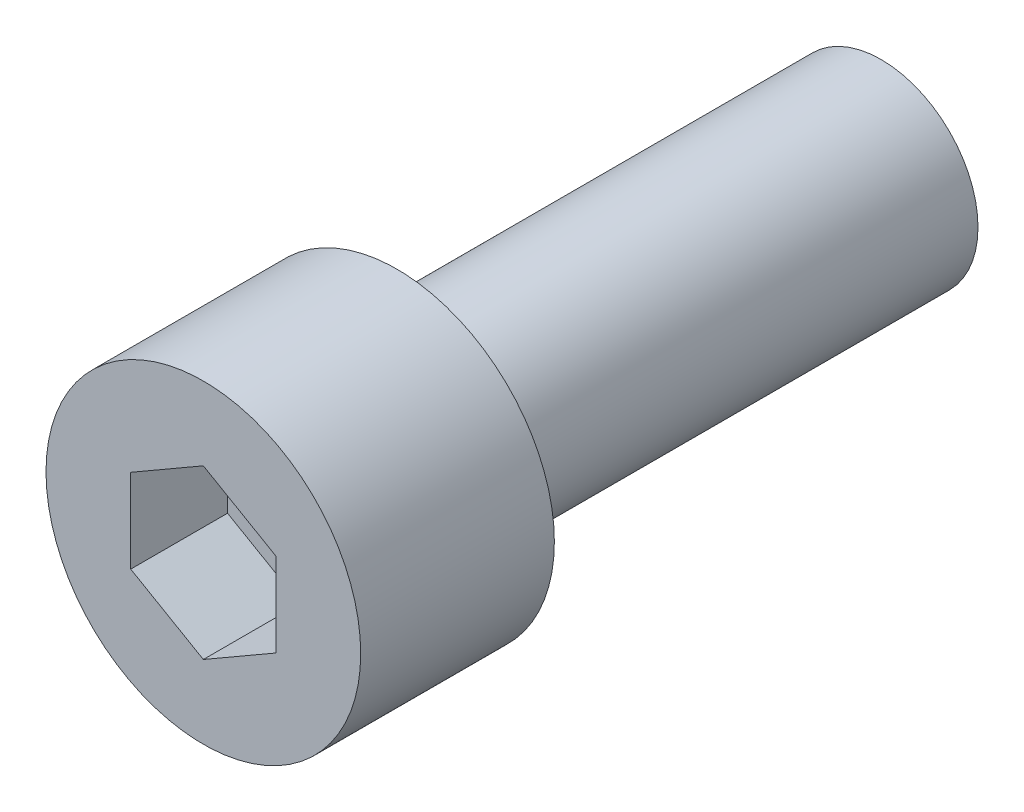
ISO-10303-21;
HEADER;
FILE_DESCRIPTION(('STEP AP214'),'2;1');
FILE_NAME('part.step','',(''),(''),'','','');
FILE_SCHEMA(('AUTOMOTIVE_DESIGN { 1 0 10303 214 1 1 1 1 }'));
ENDSEC;
DATA;
#1=APPLICATION_CONTEXT('core data for automotive mechanical design processes');
#2=APPLICATION_PROTOCOL_DEFINITION('international standard','automotive_design',2000,#1);
#3=PRODUCT_CONTEXT('',#1,'mechanical');
#4=PRODUCT('Part','Part','',(#3));
#5=PRODUCT_RELATED_PRODUCT_CATEGORY('part','',(#4));
#6=PRODUCT_DEFINITION_FORMATION('','',#4);
#7=PRODUCT_DEFINITION_CONTEXT('part definition',#1,'design');
#8=PRODUCT_DEFINITION('design','',#6,#7);
#9=PRODUCT_DEFINITION_SHAPE('','',#8);
#10=(LENGTH_UNIT() NAMED_UNIT(*) SI_UNIT(.MILLI.,.METRE.));
#11=(NAMED_UNIT(*) PLANE_ANGLE_UNIT() SI_UNIT($,.RADIAN.));
#12=(NAMED_UNIT(*) SI_UNIT($,.STERADIAN.) SOLID_ANGLE_UNIT());
#13=UNCERTAINTY_MEASURE_WITH_UNIT(LENGTH_MEASURE(1.E-05),#10,'distance_accuracy_value','');
#14=(GEOMETRIC_REPRESENTATION_CONTEXT(3) GLOBAL_UNCERTAINTY_ASSIGNED_CONTEXT((#13)) GLOBAL_UNIT_ASSIGNED_CONTEXT((#10,
#11,#12)) REPRESENTATION_CONTEXT('',''));
#15=CARTESIAN_POINT('',(0.,0.,0.));
#16=DIRECTION('',(0.,0.,1.));
#17=DIRECTION('',(1.,0.,0.));
#18=AXIS2_PLACEMENT_3D('',#15,#16,#17);
#19=CARTESIAN_POINT('',(4.,0.,-20.));
#20=DIRECTION('',(0.,0.,-1.));
#21=DIRECTION('',(-1.,0.,0.));
#22=AXIS2_PLACEMENT_3D('',#19,#20,#21);
#23=PLANE('',#22);
#24=CARTESIAN_POINT('',(0.,0.,-20.));
#25=DIRECTION('',(0.,0.,-1.));
#26=DIRECTION('',(-1.,0.,0.));
#27=AXIS2_PLACEMENT_3D('',#24,#25,#26);
#28=CIRCLE('',#27,4.);
#29=CARTESIAN_POINT('',(-4.,0.,-20.));
#30=VERTEX_POINT('',#29);
#31=EDGE_CURVE('E11',#30,#30,#28,.T.);
#32=ORIENTED_EDGE('',*,*,#31,.T.);
#33=EDGE_LOOP('',(#32));
#34=FACE_BOUND('',#33,.T.);
#35=ADVANCED_FACE('F17',(#34),#23,.T.);
#36=CARTESIAN_POINT('',(0.,3.46410161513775,4.));
#37=DIRECTION('',(-0.5,-0.86602540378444,0.));
#38=DIRECTION('',(0.86602540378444,-0.5,0.));
#39=AXIS2_PLACEMENT_3D('',#36,#37,#38);
#40=PLANE('',#39);
#41=DIRECTION('',(0.,0.,1.));
#42=VECTOR('',#41,1.);
#43=CARTESIAN_POINT('',(3.,1.73205080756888,4.));
#44=LINE('',#43,#42);
#45=CARTESIAN_POINT('',(3.,1.73205080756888,4.));
#46=VERTEX_POINT('',#45);
#47=CARTESIAN_POINT('',(3.,1.73205080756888,8.));
#48=VERTEX_POINT('',#47);
#49=EDGE_CURVE('E66',#46,#48,#44,.T.);
#50=ORIENTED_EDGE('',*,*,#49,.T.);
#51=DIRECTION('',(0.86602540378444,-0.5,0.));
#52=VECTOR('',#51,1.);
#53=CARTESIAN_POINT('',(0.,3.46410161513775,8.));
#54=LINE('',#53,#52);
#55=CARTESIAN_POINT('',(0.,3.46410161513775,8.));
#56=VERTEX_POINT('',#55);
#57=EDGE_CURVE('E32',#56,#48,#54,.T.);
#58=ORIENTED_EDGE('',*,*,#57,.F.);
#59=DIRECTION('',(0.,0.,1.));
#60=VECTOR('',#59,1.);
#61=CARTESIAN_POINT('',(0.,3.46410161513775,4.));
#62=LINE('',#61,#60);
#63=CARTESIAN_POINT('',(0.,3.46410161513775,4.));
#64=VERTEX_POINT('',#63);
#65=EDGE_CURVE('E36',#64,#56,#62,.T.);
#66=ORIENTED_EDGE('',*,*,#65,.F.);
#67=DIRECTION('',(0.86602540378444,-0.5,0.));
#68=VECTOR('',#67,1.);
#69=CARTESIAN_POINT('',(0.,3.46410161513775,4.));
#70=LINE('',#69,#68);
#71=EDGE_CURVE('E69',#64,#46,#70,.T.);
#72=ORIENTED_EDGE('',*,*,#71,.T.);
#73=EDGE_LOOP('',(#50,#58,#66,#72));
#74=FACE_BOUND('',#73,.T.);
#75=ADVANCED_FACE('F68',(#74),#40,.T.);
#76=CARTESIAN_POINT('',(3.,-1.73205080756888,4.));
#77=DIRECTION('',(1.,0.,0.));
#78=DIRECTION('',(0.,0.,-1.));
#79=AXIS2_PLACEMENT_3D('',#76,#77,#78);
#80=PLANE('',#79);
#81=DIRECTION('',(0.,0.,1.));
#82=VECTOR('',#81,1.);
#83=CARTESIAN_POINT('',(3.,-1.73205080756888,4.));
#84=LINE('',#83,#82);
#85=CARTESIAN_POINT('',(3.,-1.73205080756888,4.));
#86=VERTEX_POINT('',#85);
#87=CARTESIAN_POINT('',(3.,-1.73205080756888,8.));
#88=VERTEX_POINT('',#87);
#89=EDGE_CURVE('E74',#86,#88,#84,.T.);
#90=ORIENTED_EDGE('',*,*,#89,.T.);
#91=DIRECTION('',(0.,1.,0.));
#92=VECTOR('',#91,1.);
#93=CARTESIAN_POINT('',(3.,-1.73205080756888,8.));
#94=LINE('',#93,#92);
#95=EDGE_CURVE('E77',#88,#48,#94,.T.);
#96=ORIENTED_EDGE('',*,*,#95,.T.);
#97=ORIENTED_EDGE('',*,*,#49,.F.);
#98=DIRECTION('',(0.,1.,0.));
#99=VECTOR('',#98,1.);
#100=CARTESIAN_POINT('',(3.,-1.73205080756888,4.));
#101=LINE('',#100,#99);
#102=EDGE_CURVE('E104',#86,#46,#101,.T.);
#103=ORIENTED_EDGE('',*,*,#102,.F.);
#104=EDGE_LOOP('',(#90,#96,#97,#103));
#105=FACE_BOUND('',#104,.T.);
#106=ADVANCED_FACE('F78',(#105),#80,.F.);
#107=CARTESIAN_POINT('',(0.,-3.46410161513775,4.));
#108=DIRECTION('',(0.5,-0.86602540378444,0.));
#109=DIRECTION('',(0.86602540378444,0.5,0.));
#110=AXIS2_PLACEMENT_3D('',#107,#108,#109);
#111=PLANE('',#110);
#112=DIRECTION('',(0.,0.,1.));
#113=VECTOR('',#112,1.);
#114=CARTESIAN_POINT('',(0.,-3.46410161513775,4.));
#115=LINE('',#114,#113);
#116=CARTESIAN_POINT('',(0.,-3.46410161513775,4.));
#117=VERTEX_POINT('',#116);
#118=CARTESIAN_POINT('',(0.,-3.46410161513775,8.));
#119=VERTEX_POINT('',#118);
#120=EDGE_CURVE('E112',#117,#119,#115,.T.);
#121=ORIENTED_EDGE('',*,*,#120,.T.);
#122=DIRECTION('',(0.86602540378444,0.5,0.));
#123=VECTOR('',#122,1.);
#124=CARTESIAN_POINT('',(0.,-3.46410161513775,8.));
#125=LINE('',#124,#123);
#126=EDGE_CURVE('E82',#119,#88,#125,.T.);
#127=ORIENTED_EDGE('',*,*,#126,.T.);
#128=ORIENTED_EDGE('',*,*,#89,.F.);
#129=DIRECTION('',(0.86602540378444,0.5,0.));
#130=VECTOR('',#129,1.);
#131=CARTESIAN_POINT('',(0.,-3.46410161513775,4.));
#132=LINE('',#131,#130);
#133=EDGE_CURVE('E101',#117,#86,#132,.T.);
#134=ORIENTED_EDGE('',*,*,#133,.F.);
#135=EDGE_LOOP('',(#121,#127,#128,#134));
#136=FACE_BOUND('',#135,.T.);
#137=ADVANCED_FACE('F213',(#136),#111,.F.);
#138=CARTESIAN_POINT('',(0.,-3.46410161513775,4.));
#139=DIRECTION('',(0.5,0.86602540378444,0.));
#140=DIRECTION('',(-0.86602540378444,0.5,0.));
#141=AXIS2_PLACEMENT_3D('',#138,#139,#140);
#142=PLANE('',#141);
#143=DIRECTION('',(0.,0.,1.));
#144=VECTOR('',#143,1.);
#145=CARTESIAN_POINT('',(-3.,-1.73205080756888,4.));
#146=LINE('',#145,#144);
#147=CARTESIAN_POINT('',(-3.,-1.73205080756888,4.));
#148=VERTEX_POINT('',#147);
#149=CARTESIAN_POINT('',(-3.,-1.73205080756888,8.));
#150=VERTEX_POINT('',#149);
#151=EDGE_CURVE('E110',#148,#150,#146,.T.);
#152=ORIENTED_EDGE('',*,*,#151,.T.);
#153=DIRECTION('',(-0.86602540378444,0.5,0.));
#154=VECTOR('',#153,1.);
#155=CARTESIAN_POINT('',(0.,-3.46410161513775,8.));
#156=LINE('',#155,#154);
#157=EDGE_CURVE('E250',#119,#150,#156,.T.);
#158=ORIENTED_EDGE('',*,*,#157,.F.);
#159=ORIENTED_EDGE('',*,*,#120,.F.);
#160=DIRECTION('',(-0.86602540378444,0.5,0.));
#161=VECTOR('',#160,1.);
#162=CARTESIAN_POINT('',(0.,-3.46410161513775,4.));
#163=LINE('',#162,#161);
#164=EDGE_CURVE('E98',#117,#148,#163,.T.);
#165=ORIENTED_EDGE('',*,*,#164,.T.);
#166=EDGE_LOOP('',(#152,#158,#159,#165));
#167=FACE_BOUND('',#166,.T.);
#168=ADVANCED_FACE('F203',(#167),#142,.T.);
#169=CARTESIAN_POINT('',(-3.,1.73205080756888,4.));
#170=DIRECTION('',(-1.,0.,0.));
#171=DIRECTION('',(0.,-1.,0.));
#172=AXIS2_PLACEMENT_3D('',#169,#170,#171);
#173=PLANE('',#172);
#174=DIRECTION('',(0.,0.,1.));
#175=VECTOR('',#174,1.);
#176=CARTESIAN_POINT('',(-3.,1.73205080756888,4.));
#177=LINE('',#176,#175);
#178=CARTESIAN_POINT('',(-3.,1.73205080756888,4.));
#179=VERTEX_POINT('',#178);
#180=CARTESIAN_POINT('',(-3.,1.73205080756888,8.));
#181=VERTEX_POINT('',#180);
#182=EDGE_CURVE('E108',#179,#181,#177,.T.);
#183=ORIENTED_EDGE('',*,*,#182,.T.);
#184=DIRECTION('',(0.,-1.,0.));
#185=VECTOR('',#184,1.);
#186=CARTESIAN_POINT('',(-3.,1.73205080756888,8.));
#187=LINE('',#186,#185);
#188=EDGE_CURVE('E252',#181,#150,#187,.T.);
#189=ORIENTED_EDGE('',*,*,#188,.T.);
#190=ORIENTED_EDGE('',*,*,#151,.F.);
#191=DIRECTION('',(0.,-1.,0.));
#192=VECTOR('',#191,1.);
#193=CARTESIAN_POINT('',(-3.,1.73205080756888,4.));
#194=LINE('',#193,#192);
#195=EDGE_CURVE('E95',#179,#148,#194,.T.);
#196=ORIENTED_EDGE('',*,*,#195,.F.);
#197=EDGE_LOOP('',(#183,#189,#190,#196));
#198=FACE_BOUND('',#197,.T.);
#199=ADVANCED_FACE('F186',(#198),#173,.F.);
#200=CARTESIAN_POINT('',(0.,3.46410161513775,4.));
#201=DIRECTION('',(-0.5,0.86602540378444,0.));
#202=DIRECTION('',(-0.86602540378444,-0.5,0.));
#203=AXIS2_PLACEMENT_3D('',#200,#201,#202);
#204=PLANE('',#203);
#205=DIRECTION('',(-0.86602540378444,-0.5,0.));
#206=VECTOR('',#205,1.);
#207=CARTESIAN_POINT('',(0.,3.46410161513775,4.));
#208=LINE('',#207,#206);
#209=EDGE_CURVE('E92',#64,#179,#208,.T.);
#210=ORIENTED_EDGE('',*,*,#209,.F.);
#211=ORIENTED_EDGE('',*,*,#65,.T.);
#212=DIRECTION('',(-0.86602540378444,-0.5,0.));
#213=VECTOR('',#212,1.);
#214=CARTESIAN_POINT('',(0.,3.46410161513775,8.));
#215=LINE('',#214,#213);
#216=EDGE_CURVE('E88',#56,#181,#215,.T.);
#217=ORIENTED_EDGE('',*,*,#216,.T.);
#218=ORIENTED_EDGE('',*,*,#182,.F.);
#219=EDGE_LOOP('',(#210,#211,#217,#218));
#220=FACE_BOUND('',#219,.T.);
#221=ADVANCED_FACE('F138',(#220),#204,.F.);
#222=CARTESIAN_POINT('',(-3.,5.19615242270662,4.));
#223=DIRECTION('',(0.,0.,-1.));
#224=DIRECTION('',(-1.,0.,0.));
#225=AXIS2_PLACEMENT_3D('',#222,#223,#224);
#226=PLANE('',#225);
#227=ORIENTED_EDGE('',*,*,#71,.F.);
#228=ORIENTED_EDGE('',*,*,#209,.T.);
#229=ORIENTED_EDGE('',*,*,#195,.T.);
#230=ORIENTED_EDGE('',*,*,#164,.F.);
#231=ORIENTED_EDGE('',*,*,#133,.T.);
#232=ORIENTED_EDGE('',*,*,#102,.T.);
#233=EDGE_LOOP('',(#227,#228,#229,#230,#231,#232));
#234=FACE_BOUND('',#233,.T.);
#235=ADVANCED_FACE('F136',(#234),#226,.F.);
#236=CARTESIAN_POINT('',(0.,0.,8.));
#237=DIRECTION('',(0.,0.,1.));
#238=DIRECTION('',(1.,0.,0.));
#239=AXIS2_PLACEMENT_3D('',#236,#237,#238);
#240=PLANE('',#239);
#241=CARTESIAN_POINT('',(0.,0.,8.));
#242=DIRECTION('',(0.,0.,1.));
#243=DIRECTION('',(1.,0.,0.));
#244=AXIS2_PLACEMENT_3D('',#241,#242,#243);
#245=CIRCLE('',#244,6.5);
#246=CARTESIAN_POINT('',(6.5,0.,8.));
#247=VERTEX_POINT('',#246);
#248=EDGE_CURVE('E25',#247,#247,#245,.T.);
#249=ORIENTED_EDGE('',*,*,#248,.T.);
#250=EDGE_LOOP('',(#249));
#251=FACE_BOUND('',#250,.T.);
#252=ORIENTED_EDGE('',*,*,#216,.F.);
#253=ORIENTED_EDGE('',*,*,#57,.T.);
#254=ORIENTED_EDGE('',*,*,#95,.F.);
#255=ORIENTED_EDGE('',*,*,#126,.F.);
#256=ORIENTED_EDGE('',*,*,#157,.T.);
#257=ORIENTED_EDGE('',*,*,#188,.F.);
#258=EDGE_LOOP('',(#252,#253,#254,#255,#256,#257));
#259=FACE_BOUND('',#258,.T.);
#260=ADVANCED_FACE('F85',(#251,#259),#240,.T.);
#261=CARTESIAN_POINT('',(0.,0.,0.));
#262=DIRECTION('',(0.,0.,1.));
#263=DIRECTION('',(1.,0.,0.));
#264=AXIS2_PLACEMENT_3D('',#261,#262,#263);
#265=CYLINDRICAL_SURFACE('',#264,6.5);
#266=CARTESIAN_POINT('',(0.,0.,0.));
#267=DIRECTION('',(0.,0.,1.));
#268=DIRECTION('',(1.,0.,0.));
#269=AXIS2_PLACEMENT_3D('',#266,#267,#268);
#270=CIRCLE('',#269,6.5);
#271=CARTESIAN_POINT('',(6.5,0.,0.));
#272=VERTEX_POINT('',#271);
#273=EDGE_CURVE('E117',#272,#272,#270,.T.);
#274=ORIENTED_EDGE('',*,*,#273,.T.);
#275=EDGE_LOOP('',(#274));
#276=FACE_BOUND('',#275,.T.);
#277=ORIENTED_EDGE('',*,*,#248,.F.);
#278=EDGE_LOOP('',(#277));
#279=FACE_BOUND('',#278,.T.);
#280=ADVANCED_FACE('F123',(#276,#279),#265,.T.);
#281=CARTESIAN_POINT('',(6.5,0.,0.));
#282=DIRECTION('',(0.,0.,-1.));
#283=DIRECTION('',(-1.,0.,0.));
#284=AXIS2_PLACEMENT_3D('',#281,#282,#283);
#285=PLANE('',#284);
#286=CARTESIAN_POINT('',(0.,0.,0.));
#287=DIRECTION('',(0.,0.,1.));
#288=DIRECTION('',(1.,0.,0.));
#289=AXIS2_PLACEMENT_3D('',#286,#287,#288);
#290=CIRCLE('',#289,4.);
#291=CARTESIAN_POINT('',(4.,0.,0.));
#292=VERTEX_POINT('',#291);
#293=EDGE_CURVE('E73',#292,#292,#290,.T.);
#294=ORIENTED_EDGE('',*,*,#293,.T.);
#295=EDGE_LOOP('',(#294));
#296=FACE_BOUND('',#295,.T.);
#297=ORIENTED_EDGE('',*,*,#273,.F.);
#298=EDGE_LOOP('',(#297));
#299=FACE_BOUND('',#298,.T.);
#300=ADVANCED_FACE('F125',(#296,#299),#285,.T.);
#301=CARTESIAN_POINT('',(0.,0.,0.));
#302=DIRECTION('',(0.,0.,1.));
#303=DIRECTION('',(1.,0.,0.));
#304=AXIS2_PLACEMENT_3D('',#301,#302,#303);
#305=CYLINDRICAL_SURFACE('',#304,4.);
#306=ORIENTED_EDGE('',*,*,#31,.F.);
#307=EDGE_LOOP('',(#306));
#308=FACE_BOUND('',#307,.T.);
#309=ORIENTED_EDGE('',*,*,#293,.F.);
#310=EDGE_LOOP('',(#309));
#311=FACE_BOUND('',#310,.T.);
#312=ADVANCED_FACE('F19',(#308,#311),#305,.T.);
#313=CLOSED_SHELL('',(#35,#75,#106,#137,#168,#199,#221,#235,#260,#280,#300,#312));
#314=MANIFOLD_SOLID_BREP('B1',#313);
#315=ADVANCED_BREP_SHAPE_REPRESENTATION('',(#18,#314),#14);
#316=SHAPE_DEFINITION_REPRESENTATION(#9,#315);
ENDSEC;
END-ISO-10303-21;
